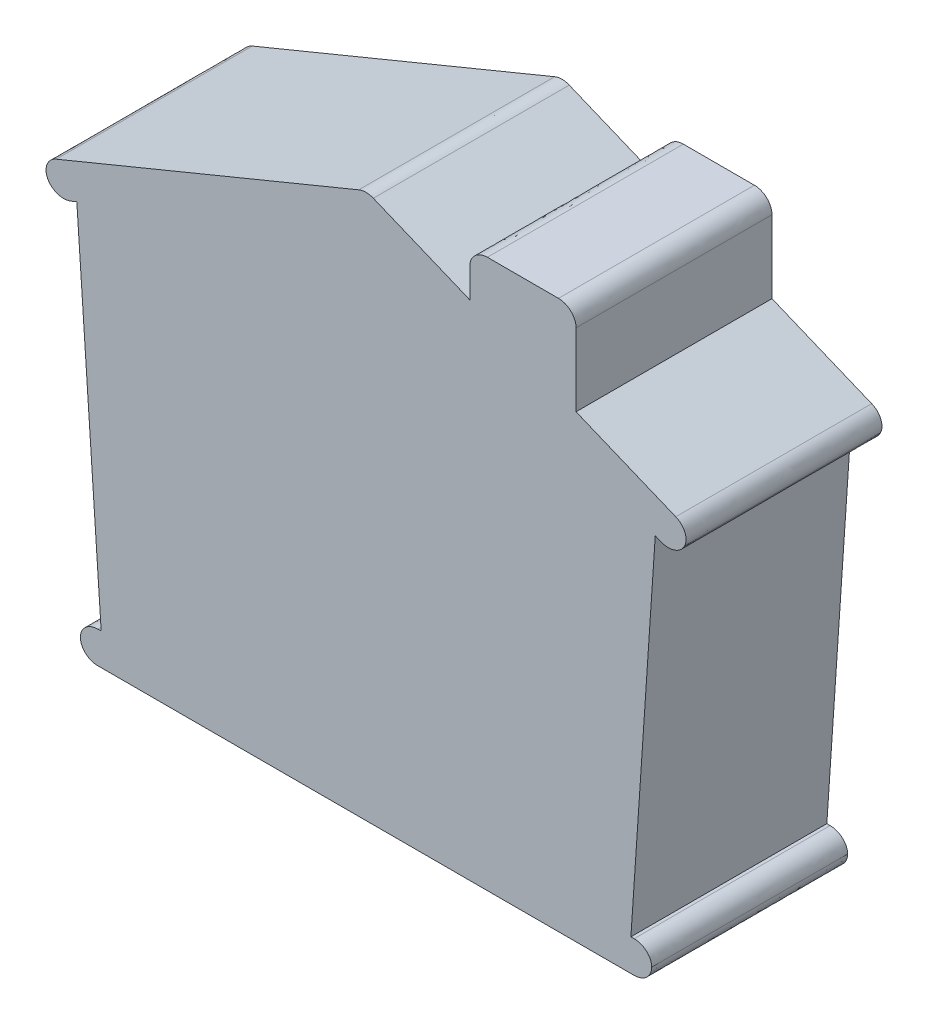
ISO-10303-21;
HEADER;
FILE_DESCRIPTION(('STEP AP214'),'2;1');
FILE_NAME('part.step','',(''),(''),'','','');
FILE_SCHEMA(('AUTOMOTIVE_DESIGN { 1 0 10303 214 1 1 1 1 }'));
ENDSEC;
DATA;
#1=APPLICATION_CONTEXT('core data for automotive mechanical design processes');
#2=APPLICATION_PROTOCOL_DEFINITION('international standard','automotive_design',2000,#1);
#3=PRODUCT_CONTEXT('',#1,'mechanical');
#4=PRODUCT('Part','Part','',(#3));
#5=PRODUCT_RELATED_PRODUCT_CATEGORY('part','',(#4));
#6=PRODUCT_DEFINITION_FORMATION('','',#4);
#7=PRODUCT_DEFINITION_CONTEXT('part definition',#1,'design');
#8=PRODUCT_DEFINITION('design','',#6,#7);
#9=PRODUCT_DEFINITION_SHAPE('','',#8);
#10=(LENGTH_UNIT() NAMED_UNIT(*) SI_UNIT(.MILLI.,.METRE.));
#11=(NAMED_UNIT(*) PLANE_ANGLE_UNIT() SI_UNIT($,.RADIAN.));
#12=(NAMED_UNIT(*) SI_UNIT($,.STERADIAN.) SOLID_ANGLE_UNIT());
#13=UNCERTAINTY_MEASURE_WITH_UNIT(LENGTH_MEASURE(1.E-05),#10,'distance_accuracy_value','');
#14=(GEOMETRIC_REPRESENTATION_CONTEXT(3) GLOBAL_UNCERTAINTY_ASSIGNED_CONTEXT((#13)) GLOBAL_UNIT_ASSIGNED_CONTEXT((#10,
#11,#12)) REPRESENTATION_CONTEXT('',''));
#15=CARTESIAN_POINT('',(0.,0.,0.));
#16=DIRECTION('',(0.,0.,1.));
#17=DIRECTION('',(1.,0.,0.));
#18=AXIS2_PLACEMENT_3D('',#15,#16,#17);
#19=CARTESIAN_POINT('',(54.7063993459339,-117.828000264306,25.));
#20=CARTESIAN_POINT('',(55.7428993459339,-133.106000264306,25.));
#21=CARTESIAN_POINT('',(56.7792993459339,-148.415600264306,25.));
#22=CARTESIAN_POINT('',(57.8153993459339,-163.702200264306,25.));
#23=B_SPLINE_CURVE_WITH_KNOTS('',3,(#19,#20,#21,#22),.UNSPECIFIED.,.F.,.F.,(4,4),(0.,
0.0344827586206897),.UNSPECIFIED.);
#24=DIRECTION('',(0.,0.,-1.));
#25=VECTOR('',#24,1.);
#26=SURFACE_OF_LINEAR_EXTRUSION('',#23,#25);
#27=CARTESIAN_POINT('',(54.7063993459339,-117.828000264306,0.));
#28=CARTESIAN_POINT('',(55.7428993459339,-133.106000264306,0.));
#29=CARTESIAN_POINT('',(56.7792993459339,-148.415600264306,0.));
#30=CARTESIAN_POINT('',(57.8153993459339,-163.702200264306,0.));
#31=B_SPLINE_CURVE_WITH_KNOTS('',3,(#27,#28,#29,#30),.UNSPECIFIED.,.F.,.F.,(4,4),(0.,
0.0344827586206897),.UNSPECIFIED.);
#32=CARTESIAN_POINT('',(54.7063993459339,-117.828000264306,0.));
#33=VERTEX_POINT('',#32);
#34=CARTESIAN_POINT('',(57.8153993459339,-163.702200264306,0.));
#35=VERTEX_POINT('',#34);
#36=EDGE_CURVE('E422',#33,#35,#31,.T.);
#37=ORIENTED_EDGE('',*,*,#36,.T.);
#38=DIRECTION('',(0.,0.,-1.));
#39=VECTOR('',#38,1.);
#40=CARTESIAN_POINT('',(57.8153993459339,-163.702200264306,25.));
#41=LINE('',#40,#39);
#42=CARTESIAN_POINT('',(57.8153993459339,-163.702200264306,25.));
#43=VERTEX_POINT('',#42);
#44=EDGE_CURVE('E11',#43,#35,#41,.T.);
#45=ORIENTED_EDGE('',*,*,#44,.F.);
#46=CARTESIAN_POINT('',(54.7063993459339,-117.828000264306,25.));
#47=VERTEX_POINT('',#46);
#48=EDGE_CURVE('E563',#47,#43,#23,.T.);
#49=ORIENTED_EDGE('',*,*,#48,.F.);
#50=DIRECTION('',(0.,0.,-1.));
#51=VECTOR('',#50,1.);
#52=CARTESIAN_POINT('',(54.7063993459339,-117.828000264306,25.));
#53=LINE('',#52,#51);
#54=EDGE_CURVE('E236',#47,#33,#53,.T.);
#55=ORIENTED_EDGE('',*,*,#54,.T.);
#56=EDGE_LOOP('',(#37,#45,#49,#55));
#57=FACE_BOUND('',#56,.T.);
#58=ADVANCED_FACE('F35',(#57),#26,.F.);
#59=CARTESIAN_POINT('',(57.4029907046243,-163.702200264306,25.));
#60=DIRECTION('',(0.,-1.,0.));
#61=DIRECTION('',(0.,0.,-1.));
#62=AXIS2_PLACEMENT_3D('',#59,#60,#61);
#63=PLANE('',#62);
#64=DIRECTION('',(-1.,0.,0.));
#65=VECTOR('',#64,1.);
#66=CARTESIAN_POINT('',(57.4029907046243,-163.702200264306,0.));
#67=LINE('',#66,#65);
#68=CARTESIAN_POINT('',(57.4029907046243,-163.702200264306,0.));
#69=VERTEX_POINT('',#68);
#70=EDGE_CURVE('E416',#35,#69,#67,.T.);
#71=ORIENTED_EDGE('',*,*,#70,.T.);
#72=DIRECTION('',(0.,0.,-1.));
#73=VECTOR('',#72,1.);
#74=CARTESIAN_POINT('',(57.4029907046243,-163.702200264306,25.));
#75=LINE('',#74,#73);
#76=CARTESIAN_POINT('',(57.4029907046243,-163.702200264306,25.));
#77=VERTEX_POINT('',#76);
#78=EDGE_CURVE('E44',#77,#69,#75,.T.);
#79=ORIENTED_EDGE('',*,*,#78,.F.);
#80=DIRECTION('',(-1.,0.,0.));
#81=VECTOR('',#80,1.);
#82=CARTESIAN_POINT('',(57.4029907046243,-163.702200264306,25.));
#83=LINE('',#82,#81);
#84=EDGE_CURVE('E149',#43,#77,#83,.T.);
#85=ORIENTED_EDGE('',*,*,#84,.F.);
#86=ORIENTED_EDGE('',*,*,#44,.T.);
#87=EDGE_LOOP('',(#71,#79,#85,#86));
#88=FACE_BOUND('',#87,.T.);
#89=ADVANCED_FACE('F600',(#88),#63,.F.);
#90=CARTESIAN_POINT('',(57.4029907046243,-163.702200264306,25.));
#91=CARTESIAN_POINT('',(56.167595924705,-163.702200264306,25.));
#92=CARTESIAN_POINT('',(55.1600004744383,-164.613096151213,25.));
#93=CARTESIAN_POINT('',(55.1600001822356,-165.729891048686,25.));
#94=B_SPLINE_CURVE_WITH_KNOTS('',3,(#90,#91,#92,#93),.UNSPECIFIED.,.F.,.F.,(4,4),
(0.896551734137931,0.931034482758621),.UNSPECIFIED.);
#95=DIRECTION('',(0.,0.,-1.));
#96=VECTOR('',#95,1.);
#97=SURFACE_OF_LINEAR_EXTRUSION('',#94,#96);
#98=CARTESIAN_POINT('',(57.4029907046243,-163.702200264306,0.));
#99=CARTESIAN_POINT('',(56.167595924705,-163.702200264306,0.));
#100=CARTESIAN_POINT('',(55.1600004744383,-164.613096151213,0.));
#101=CARTESIAN_POINT('',(55.1600001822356,-165.729891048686,0.));
#102=B_SPLINE_CURVE_WITH_KNOTS('',3,(#98,#99,#100,#101),.UNSPECIFIED.,.F.,.F.,(4,4),
(0.896551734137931,0.931034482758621),.UNSPECIFIED.);
#103=CARTESIAN_POINT('',(55.1600001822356,-165.729891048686,0.));
#104=VERTEX_POINT('',#103);
#105=EDGE_CURVE('E410',#69,#104,#102,.T.);
#106=ORIENTED_EDGE('',*,*,#105,.T.);
#107=DIRECTION('',(0.,0.,-1.));
#108=VECTOR('',#107,1.);
#109=CARTESIAN_POINT('',(55.1600001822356,-165.729891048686,25.));
#110=LINE('',#109,#108);
#111=CARTESIAN_POINT('',(55.1600001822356,-165.729891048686,25.));
#112=VERTEX_POINT('',#111);
#113=EDGE_CURVE('E402',#112,#104,#110,.T.);
#114=ORIENTED_EDGE('',*,*,#113,.F.);
#115=EDGE_CURVE('E411',#77,#112,#94,.T.);
#116=ORIENTED_EDGE('',*,*,#115,.F.);
#117=ORIENTED_EDGE('',*,*,#78,.T.);
#118=EDGE_LOOP('',(#106,#114,#116,#117));
#119=FACE_BOUND('',#118,.T.);
#120=ADVANCED_FACE('F408',(#119),#97,.F.);
#121=CARTESIAN_POINT('',(55.1600001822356,-165.729891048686,25.));
#122=CARTESIAN_POINT('',(55.1600001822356,-166.846791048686,25.));
#123=CARTESIAN_POINT('',(56.1675998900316,-167.757690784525,25.));
#124=CARTESIAN_POINT('',(57.4029994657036,-167.757691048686,25.));
#125=B_SPLINE_CURVE_WITH_KNOTS('',3,(#121,#122,#123,#124),.UNSPECIFIED.,.F.,.F.,(4,4),
(0.827586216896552,0.862068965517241),.UNSPECIFIED.);
#126=DIRECTION('',(0.,0.,-1.));
#127=VECTOR('',#126,1.);
#128=SURFACE_OF_LINEAR_EXTRUSION('',#125,#127);
#129=CARTESIAN_POINT('',(55.1600001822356,-165.729891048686,0.));
#130=CARTESIAN_POINT('',(55.1600001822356,-166.846791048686,0.));
#131=CARTESIAN_POINT('',(56.1675998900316,-167.757690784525,0.));
#132=CARTESIAN_POINT('',(57.4029994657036,-167.757691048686,0.));
#133=B_SPLINE_CURVE_WITH_KNOTS('',3,(#129,#130,#131,#132),.UNSPECIFIED.,.F.,.F.,(4,4),
(0.827586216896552,0.862068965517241),.UNSPECIFIED.);
#134=CARTESIAN_POINT('',(57.4029994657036,-167.757691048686,0.));
#135=VERTEX_POINT('',#134);
#136=EDGE_CURVE('E418',#104,#135,#133,.T.);
#137=ORIENTED_EDGE('',*,*,#136,.T.);
#138=DIRECTION('',(0.,0.,-1.));
#139=VECTOR('',#138,1.);
#140=CARTESIAN_POINT('',(57.4029994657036,-167.757691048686,25.));
#141=LINE('',#140,#139);
#142=CARTESIAN_POINT('',(57.4029994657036,-167.757691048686,25.));
#143=VERTEX_POINT('',#142);
#144=EDGE_CURVE('E399',#143,#135,#141,.T.);
#145=ORIENTED_EDGE('',*,*,#144,.F.);
#146=EDGE_CURVE('E588',#112,#143,#125,.T.);
#147=ORIENTED_EDGE('',*,*,#146,.F.);
#148=ORIENTED_EDGE('',*,*,#113,.T.);
#149=EDGE_LOOP('',(#137,#145,#147,#148));
#150=FACE_BOUND('',#149,.T.);
#151=ADVANCED_FACE('F599',(#150),#128,.F.);
#152=CARTESIAN_POINT('',(57.4029994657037,-167.757691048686,25.));
#153=DIRECTION('',(0.,1.,0.));
#154=DIRECTION('',(0.,0.,1.));
#155=AXIS2_PLACEMENT_3D('',#152,#153,#154);
#156=PLANE('',#155);
#157=CARTESIAN_POINT('',(57.4029994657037,-167.757691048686,0.));
#158=CARTESIAN_POINT('',(125.814679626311,-167.757691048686,0.));
#159=CARTESIAN_POINT('',(125.814699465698,-167.757691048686,0.));
#160=B_SPLINE_CURVE_WITH_KNOTS('',2,(#157,#158,#159),.UNSPECIFIED.,.F.,.F.,(3,3),
(0.793103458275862,0.827586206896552),.UNSPECIFIED.);
#161=CARTESIAN_POINT('',(125.814699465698,-167.757691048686,0.));
#162=VERTEX_POINT('',#161);
#163=EDGE_CURVE('E420',#135,#162,#160,.T.);
#164=ORIENTED_EDGE('',*,*,#163,.T.);
#165=DIRECTION('',(0.,0.,-1.));
#166=VECTOR('',#165,1.);
#167=CARTESIAN_POINT('',(125.814699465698,-167.757691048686,25.));
#168=LINE('',#167,#166);
#169=CARTESIAN_POINT('',(125.814699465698,-167.757691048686,25.));
#170=VERTEX_POINT('',#169);
#171=EDGE_CURVE('E396',#170,#162,#168,.T.);
#172=ORIENTED_EDGE('',*,*,#171,.F.);
#173=CARTESIAN_POINT('',(57.4029994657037,-167.757691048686,25.));
#174=CARTESIAN_POINT('',(125.814679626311,-167.757691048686,25.));
#175=CARTESIAN_POINT('',(125.814699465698,-167.757691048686,25.));
#176=B_SPLINE_CURVE_WITH_KNOTS('',2,(#173,#174,#175),.UNSPECIFIED.,.F.,.F.,(3,3),
(0.793103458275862,0.827586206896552),.UNSPECIFIED.);
#177=EDGE_CURVE('E904',#143,#170,#176,.T.);
#178=ORIENTED_EDGE('',*,*,#177,.F.);
#179=ORIENTED_EDGE('',*,*,#144,.T.);
#180=EDGE_LOOP('',(#164,#172,#178,#179));
#181=FACE_BOUND('',#180,.T.);
#182=ADVANCED_FACE('F627',(#181),#156,.F.);
#183=CARTESIAN_POINT('',(125.814699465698,-167.757691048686,25.));
#184=CARTESIAN_POINT('',(127.050099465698,-167.757691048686,25.));
#185=CARTESIAN_POINT('',(128.057699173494,-166.846791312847,25.));
#186=CARTESIAN_POINT('',(128.057699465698,-165.729891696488,25.));
#187=B_SPLINE_CURVE_WITH_KNOTS('',3,(#183,#184,#185,#186),.UNSPECIFIED.,.F.,.F.,(4,4),
(0.758620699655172,0.793103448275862),.UNSPECIFIED.);
#188=DIRECTION('',(0.,0.,-1.));
#189=VECTOR('',#188,1.);
#190=SURFACE_OF_LINEAR_EXTRUSION('',#187,#189);
#191=CARTESIAN_POINT('',(125.814699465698,-167.757691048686,0.));
#192=CARTESIAN_POINT('',(127.050099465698,-167.757691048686,0.));
#193=CARTESIAN_POINT('',(128.057699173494,-166.846791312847,0.));
#194=CARTESIAN_POINT('',(128.057699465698,-165.729891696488,0.));
#195=B_SPLINE_CURVE_WITH_KNOTS('',3,(#191,#192,#193,#194),.UNSPECIFIED.,.F.,.F.,(4,4),
(0.758620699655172,0.793103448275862),.UNSPECIFIED.);
#196=CARTESIAN_POINT('',(128.057699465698,-165.729891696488,0.));
#197=VERTEX_POINT('',#196);
#198=EDGE_CURVE('E438',#162,#197,#195,.T.);
#199=ORIENTED_EDGE('',*,*,#198,.T.);
#200=DIRECTION('',(0.,0.,-1.));
#201=VECTOR('',#200,1.);
#202=CARTESIAN_POINT('',(128.057699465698,-165.729891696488,25.));
#203=LINE('',#202,#201);
#204=CARTESIAN_POINT('',(128.057699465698,-165.729891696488,25.));
#205=VERTEX_POINT('',#204);
#206=EDGE_CURVE('E393',#205,#197,#203,.T.);
#207=ORIENTED_EDGE('',*,*,#206,.F.);
#208=EDGE_CURVE('E901',#170,#205,#187,.T.);
#209=ORIENTED_EDGE('',*,*,#208,.F.);
#210=ORIENTED_EDGE('',*,*,#171,.T.);
#211=EDGE_LOOP('',(#199,#207,#209,#210));
#212=FACE_BOUND('',#211,.T.);
#213=ADVANCED_FACE('F636',(#212),#190,.F.);
#214=CARTESIAN_POINT('',(128.057699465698,-165.729891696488,25.));
#215=CARTESIAN_POINT('',(128.057699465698,-164.613091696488,25.));
#216=CARTESIAN_POINT('',(127.050099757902,-163.702191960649,25.));
#217=CARTESIAN_POINT('',(125.81470018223,-163.702191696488,25.));
#218=B_SPLINE_CURVE_WITH_KNOTS('',3,(#214,#215,#216,#217),.UNSPECIFIED.,.F.,.F.,(4,4),
(0.689655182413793,0.724137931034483),.UNSPECIFIED.);
#219=DIRECTION('',(0.,0.,-1.));
#220=VECTOR('',#219,1.);
#221=SURFACE_OF_LINEAR_EXTRUSION('',#218,#220);
#222=CARTESIAN_POINT('',(128.057699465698,-165.729891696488,0.));
#223=CARTESIAN_POINT('',(128.057699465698,-164.613091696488,0.));
#224=CARTESIAN_POINT('',(127.050099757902,-163.702191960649,0.));
#225=CARTESIAN_POINT('',(125.81470018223,-163.702191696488,0.));
#226=B_SPLINE_CURVE_WITH_KNOTS('',3,(#222,#223,#224,#225),.UNSPECIFIED.,.F.,.F.,(4,4),
(0.689655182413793,0.724137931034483),.UNSPECIFIED.);
#227=CARTESIAN_POINT('',(125.81470018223,-163.702191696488,0.));
#228=VERTEX_POINT('',#227);
#229=EDGE_CURVE('E445',#197,#228,#226,.T.);
#230=ORIENTED_EDGE('',*,*,#229,.T.);
#231=DIRECTION('',(0.,0.,-1.));
#232=VECTOR('',#231,1.);
#233=CARTESIAN_POINT('',(125.81470018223,-163.702191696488,25.));
#234=LINE('',#233,#232);
#235=CARTESIAN_POINT('',(125.81470018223,-163.702191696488,25.));
#236=VERTEX_POINT('',#235);
#237=EDGE_CURVE('E390',#236,#228,#234,.T.);
#238=ORIENTED_EDGE('',*,*,#237,.F.);
#239=EDGE_CURVE('E899',#205,#236,#218,.T.);
#240=ORIENTED_EDGE('',*,*,#239,.F.);
#241=ORIENTED_EDGE('',*,*,#206,.T.);
#242=EDGE_LOOP('',(#230,#238,#240,#241));
#243=FACE_BOUND('',#242,.T.);
#244=ADVANCED_FACE('F645',(#243),#221,.F.);
#245=CARTESIAN_POINT('',(125.81470018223,-163.702191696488,25.));
#246=DIRECTION('',(0.,-1.,0.));
#247=DIRECTION('',(0.,0.,-1.));
#248=AXIS2_PLACEMENT_3D('',#245,#246,#247);
#249=PLANE('',#248);
#250=DIRECTION('',(-1.,0.,0.));
#251=VECTOR('',#250,1.);
#252=CARTESIAN_POINT('',(125.81470018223,-163.702191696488,0.));
#253=LINE('',#252,#251);
#254=CARTESIAN_POINT('',(125.402299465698,-163.702191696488,0.));
#255=VERTEX_POINT('',#254);
#256=EDGE_CURVE('E452',#228,#255,#253,.T.);
#257=ORIENTED_EDGE('',*,*,#256,.T.);
#258=DIRECTION('',(0.,0.,-1.));
#259=VECTOR('',#258,1.);
#260=CARTESIAN_POINT('',(125.402299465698,-163.702191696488,25.));
#261=LINE('',#260,#259);
#262=CARTESIAN_POINT('',(125.402299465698,-163.702191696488,25.));
#263=VERTEX_POINT('',#262);
#264=EDGE_CURVE('E387',#263,#255,#261,.T.);
#265=ORIENTED_EDGE('',*,*,#264,.F.);
#266=DIRECTION('',(-1.,0.,0.));
#267=VECTOR('',#266,1.);
#268=CARTESIAN_POINT('',(125.81470018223,-163.702191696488,25.));
#269=LINE('',#268,#267);
#270=EDGE_CURVE('E893',#236,#263,#269,.T.);
#271=ORIENTED_EDGE('',*,*,#270,.F.);
#272=ORIENTED_EDGE('',*,*,#237,.T.);
#273=EDGE_LOOP('',(#257,#265,#271,#272));
#274=FACE_BOUND('',#273,.T.);
#275=ADVANCED_FACE('F655',(#274),#249,.F.);
#276=CARTESIAN_POINT('',(125.402299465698,-163.702191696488,25.));
#277=CARTESIAN_POINT('',(126.438299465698,-148.415591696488,25.));
#278=CARTESIAN_POINT('',(127.474799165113,-133.105996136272,25.));
#279=CARTESIAN_POINT('',(128.511298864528,-117.828000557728,25.));
#280=B_SPLINE_CURVE_WITH_KNOTS('',3,(#276,#277,#278,#279),.UNSPECIFIED.,.F.,.F.,(4,4),
(0.620689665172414,0.655172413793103),.UNSPECIFIED.);
#281=DIRECTION('',(0.,0.,-1.));
#282=VECTOR('',#281,1.);
#283=SURFACE_OF_LINEAR_EXTRUSION('',#280,#282);
#284=CARTESIAN_POINT('',(125.402299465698,-163.702191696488,0.));
#285=CARTESIAN_POINT('',(126.438299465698,-148.415591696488,0.));
#286=CARTESIAN_POINT('',(127.474799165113,-133.105996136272,0.));
#287=CARTESIAN_POINT('',(128.511298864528,-117.828000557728,0.));
#288=B_SPLINE_CURVE_WITH_KNOTS('',3,(#284,#285,#286,#287),.UNSPECIFIED.,.F.,.F.,(4,4),
(0.620689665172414,0.655172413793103),.UNSPECIFIED.);
#289=CARTESIAN_POINT('',(128.511298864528,-117.828000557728,0.));
#290=VERTEX_POINT('',#289);
#291=EDGE_CURVE('E457',#255,#290,#288,.T.);
#292=ORIENTED_EDGE('',*,*,#291,.T.);
#293=DIRECTION('',(0.,0.,-1.));
#294=VECTOR('',#293,1.);
#295=CARTESIAN_POINT('',(128.511298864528,-117.828000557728,25.));
#296=LINE('',#295,#294);
#297=CARTESIAN_POINT('',(128.511298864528,-117.828000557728,25.));
#298=VERTEX_POINT('',#297);
#299=EDGE_CURVE('E384',#298,#290,#296,.T.);
#300=ORIENTED_EDGE('',*,*,#299,.F.);
#301=EDGE_CURVE('E890',#263,#298,#280,.T.);
#302=ORIENTED_EDGE('',*,*,#301,.F.);
#303=ORIENTED_EDGE('',*,*,#264,.T.);
#304=EDGE_LOOP('',(#292,#300,#302,#303));
#305=FACE_BOUND('',#304,.T.);
#306=ADVANCED_FACE('F665',(#305),#283,.F.);
#307=CARTESIAN_POINT('',(128.511298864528,-117.828000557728,25.));
#308=DIRECTION('',(0.374809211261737,0.927101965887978,0.));
#309=DIRECTION('',(-0.927101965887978,0.374809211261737,0.));
#310=AXIS2_PLACEMENT_3D('',#307,#308,#309);
#311=PLANE('',#310);
#312=CARTESIAN_POINT('',(128.511298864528,-117.828000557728,0.));
#313=CARTESIAN_POINT('',(129.272898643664,-118.135900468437,0.));
#314=CARTESIAN_POINT('',(129.272898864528,-118.135900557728,0.));
#315=B_SPLINE_CURVE_WITH_KNOTS('',2,(#312,#313,#314),.UNSPECIFIED.,.F.,.F.,(3,3),
(0.586206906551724,0.620689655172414),.UNSPECIFIED.);
#316=CARTESIAN_POINT('',(129.272898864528,-118.135900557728,0.));
#317=VERTEX_POINT('',#316);
#318=EDGE_CURVE('E461',#290,#317,#315,.T.);
#319=ORIENTED_EDGE('',*,*,#318,.T.);
#320=DIRECTION('',(0.,0.,-1.));
#321=VECTOR('',#320,1.);
#322=CARTESIAN_POINT('',(129.272898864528,-118.135900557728,25.));
#323=LINE('',#322,#321);
#324=CARTESIAN_POINT('',(129.272898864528,-118.135900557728,25.));
#325=VERTEX_POINT('',#324);
#326=EDGE_CURVE('E381',#325,#317,#323,.T.);
#327=ORIENTED_EDGE('',*,*,#326,.F.);
#328=CARTESIAN_POINT('',(128.511298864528,-117.828000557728,25.));
#329=CARTESIAN_POINT('',(129.272898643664,-118.135900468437,25.));
#330=CARTESIAN_POINT('',(129.272898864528,-118.135900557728,25.));
#331=B_SPLINE_CURVE_WITH_KNOTS('',2,(#328,#329,#330),.UNSPECIFIED.,.F.,.F.,(3,3),
(0.586206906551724,0.620689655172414),.UNSPECIFIED.);
#332=EDGE_CURVE('E888',#298,#325,#331,.T.);
#333=ORIENTED_EDGE('',*,*,#332,.F.);
#334=ORIENTED_EDGE('',*,*,#299,.T.);
#335=EDGE_LOOP('',(#319,#327,#333,#334));
#336=FACE_BOUND('',#335,.T.);
#337=ADVANCED_FACE('F675',(#336),#311,.F.);
#338=CARTESIAN_POINT('',(129.272898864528,-118.135900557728,25.));
#339=CARTESIAN_POINT('',(130.400598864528,-118.591700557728,25.));
#340=CARTESIAN_POINT('',(131.731898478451,-118.131700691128,25.));
#341=CARTESIAN_POINT('',(132.235898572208,-117.11230114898,25.));
#342=B_SPLINE_CURVE_WITH_KNOTS('',3,(#338,#339,#340,#341),.UNSPECIFIED.,.F.,.F.,(4,4),
(0.551724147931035,0.586206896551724),.UNSPECIFIED.);
#343=DIRECTION('',(0.,0.,-1.));
#344=VECTOR('',#343,1.);
#345=SURFACE_OF_LINEAR_EXTRUSION('',#342,#344);
#346=CARTESIAN_POINT('',(129.272898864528,-118.135900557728,0.));
#347=CARTESIAN_POINT('',(130.400598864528,-118.591700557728,0.));
#348=CARTESIAN_POINT('',(131.731898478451,-118.131700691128,0.));
#349=CARTESIAN_POINT('',(132.235898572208,-117.11230114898,0.));
#350=B_SPLINE_CURVE_WITH_KNOTS('',3,(#346,#347,#348,#349),.UNSPECIFIED.,.F.,.F.,(4,4),
(0.551724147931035,0.586206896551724),.UNSPECIFIED.);
#351=CARTESIAN_POINT('',(132.235898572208,-117.11230114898,0.));
#352=VERTEX_POINT('',#351);
#353=EDGE_CURVE('E468',#317,#352,#350,.T.);
#354=ORIENTED_EDGE('',*,*,#353,.T.);
#355=DIRECTION('',(0.,0.,-1.));
#356=VECTOR('',#355,1.);
#357=CARTESIAN_POINT('',(132.235898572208,-117.11230114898,25.));
#358=LINE('',#357,#356);
#359=CARTESIAN_POINT('',(132.235898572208,-117.11230114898,25.));
#360=VERTEX_POINT('',#359);
#361=EDGE_CURVE('E378',#360,#352,#358,.T.);
#362=ORIENTED_EDGE('',*,*,#361,.F.);
#363=EDGE_CURVE('E881',#325,#360,#342,.T.);
#364=ORIENTED_EDGE('',*,*,#363,.F.);
#365=ORIENTED_EDGE('',*,*,#326,.T.);
#366=EDGE_LOOP('',(#354,#362,#364,#365));
#367=FACE_BOUND('',#366,.T.);
#368=ADVANCED_FACE('F685',(#367),#345,.F.);
#369=CARTESIAN_POINT('',(132.242598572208,-117.09890114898,25.));
#370=DIRECTION('',(-0.894427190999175,0.44721359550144,0.));
#371=DIRECTION('',(-0.44721359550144,-0.894427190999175,0.));
#372=AXIS2_PLACEMENT_3D('',#369,#370,#371);
#373=PLANE('',#372);
#374=DIRECTION('',(0.44721359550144,0.894427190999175,0.));
#375=VECTOR('',#374,1.);
#376=CARTESIAN_POINT('',(132.242598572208,-117.09890114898,0.));
#377=LINE('',#376,#375);
#378=CARTESIAN_POINT('',(132.242598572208,-117.09890114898,0.));
#379=VERTEX_POINT('',#378);
#380=EDGE_CURVE('E475',#352,#379,#377,.T.);
#381=ORIENTED_EDGE('',*,*,#380,.T.);
#382=DIRECTION('',(0.,0.,-1.));
#383=VECTOR('',#382,1.);
#384=CARTESIAN_POINT('',(132.242598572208,-117.09890114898,25.));
#385=LINE('',#384,#383);
#386=CARTESIAN_POINT('',(132.242598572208,-117.09890114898,25.));
#387=VERTEX_POINT('',#386);
#388=EDGE_CURVE('E375',#387,#379,#385,.T.);
#389=ORIENTED_EDGE('',*,*,#388,.F.);
#390=DIRECTION('',(0.44721359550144,0.894427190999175,0.));
#391=VECTOR('',#390,1.);
#392=CARTESIAN_POINT('',(132.242598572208,-117.09890114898,25.));
#393=LINE('',#392,#391);
#394=EDGE_CURVE('E856',#360,#387,#393,.T.);
#395=ORIENTED_EDGE('',*,*,#394,.F.);
#396=ORIENTED_EDGE('',*,*,#361,.T.);
#397=EDGE_LOOP('',(#381,#389,#395,#396));
#398=FACE_BOUND('',#397,.T.);
#399=ADVANCED_FACE('F695',(#398),#373,.F.);
#400=CARTESIAN_POINT('',(132.242598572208,-117.09890114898,25.));
#401=CARTESIAN_POINT('',(132.741898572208,-116.08340114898,25.));
#402=CARTESIAN_POINT('',(132.243998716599,-114.887201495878,25.));
#403=CARTESIAN_POINT('',(131.12509922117,-114.426101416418,25.));
#404=B_SPLINE_CURVE_WITH_KNOTS('',3,(#400,#401,#402,#403),.UNSPECIFIED.,.F.,.F.,(4,4),
(0.482758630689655,0.517241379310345),.UNSPECIFIED.);
#405=DIRECTION('',(0.,0.,-1.));
#406=VECTOR('',#405,1.);
#407=SURFACE_OF_LINEAR_EXTRUSION('',#404,#406);
#408=CARTESIAN_POINT('',(132.242598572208,-117.09890114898,0.));
#409=CARTESIAN_POINT('',(132.741898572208,-116.08340114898,0.));
#410=CARTESIAN_POINT('',(132.243998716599,-114.887201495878,0.));
#411=CARTESIAN_POINT('',(131.12509922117,-114.426101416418,0.));
#412=B_SPLINE_CURVE_WITH_KNOTS('',3,(#408,#409,#410,#411),.UNSPECIFIED.,.F.,.F.,(4,4),
(0.482758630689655,0.517241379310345),.UNSPECIFIED.);
#413=CARTESIAN_POINT('',(131.12509922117,-114.426101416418,0.));
#414=VERTEX_POINT('',#413);
#415=EDGE_CURVE('E480',#379,#414,#412,.T.);
#416=ORIENTED_EDGE('',*,*,#415,.T.);
#417=DIRECTION('',(0.,0.,-1.));
#418=VECTOR('',#417,1.);
#419=CARTESIAN_POINT('',(131.12509922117,-114.426101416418,25.));
#420=LINE('',#419,#418);
#421=CARTESIAN_POINT('',(131.12509922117,-114.426101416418,25.));
#422=VERTEX_POINT('',#421);
#423=EDGE_CURVE('E372',#422,#414,#420,.T.);
#424=ORIENTED_EDGE('',*,*,#423,.F.);
#425=EDGE_CURVE('E851',#387,#422,#404,.T.);
#426=ORIENTED_EDGE('',*,*,#425,.F.);
#427=ORIENTED_EDGE('',*,*,#388,.T.);
#428=EDGE_LOOP('',(#416,#424,#426,#427));
#429=FACE_BOUND('',#428,.T.);
#430=ADVANCED_FACE('F705',(#429),#407,.F.);
#431=CARTESIAN_POINT('',(131.12509922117,-114.426101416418,25.));
#432=DIRECTION('',(-0.381048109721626,-0.924555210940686,0.));
#433=DIRECTION('',(0.924555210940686,-0.381048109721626,0.));
#434=AXIS2_PLACEMENT_3D('',#431,#432,#433);
#435=PLANE('',#434);
#436=CARTESIAN_POINT('',(131.12509922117,-114.426101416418,0.));
#437=CARTESIAN_POINT('',(118.405702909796,-109.183902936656,0.));
#438=CARTESIAN_POINT('',(118.405699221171,-109.183901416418,0.));
#439=B_SPLINE_CURVE_WITH_KNOTS('',2,(#436,#437,#438),.UNSPECIFIED.,.F.,.F.,(3,3),
(0.448275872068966,0.482758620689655),.UNSPECIFIED.);
#440=CARTESIAN_POINT('',(118.405699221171,-109.183901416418,0.));
#441=VERTEX_POINT('',#440);
#442=EDGE_CURVE('E484',#414,#441,#439,.T.);
#443=ORIENTED_EDGE('',*,*,#442,.T.);
#444=DIRECTION('',(0.,0.,-1.));
#445=VECTOR('',#444,1.);
#446=CARTESIAN_POINT('',(118.405699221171,-109.183901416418,25.));
#447=LINE('',#446,#445);
#448=CARTESIAN_POINT('',(118.405699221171,-109.183901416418,25.));
#449=VERTEX_POINT('',#448);
#450=EDGE_CURVE('E369',#449,#441,#447,.T.);
#451=ORIENTED_EDGE('',*,*,#450,.F.);
#452=CARTESIAN_POINT('',(131.12509922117,-114.426101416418,25.));
#453=CARTESIAN_POINT('',(118.405702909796,-109.183902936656,25.));
#454=CARTESIAN_POINT('',(118.405699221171,-109.183901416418,25.));
#455=B_SPLINE_CURVE_WITH_KNOTS('',2,(#452,#453,#454),.UNSPECIFIED.,.F.,.F.,(3,3),
(0.448275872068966,0.482758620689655),.UNSPECIFIED.);
#456=EDGE_CURVE('E839',#422,#449,#455,.T.);
#457=ORIENTED_EDGE('',*,*,#456,.F.);
#458=ORIENTED_EDGE('',*,*,#423,.T.);
#459=EDGE_LOOP('',(#443,#451,#457,#458));
#460=FACE_BOUND('',#459,.T.);
#461=ADVANCED_FACE('F715',(#460),#435,.F.);
#462=CARTESIAN_POINT('',(118.405699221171,-109.183901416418,25.));
#463=DIRECTION('',(-1.,0.,0.));
#464=DIRECTION('',(0.,-1.,0.));
#465=AXIS2_PLACEMENT_3D('',#462,#463,#464);
#466=PLANE('',#465);
#467=CARTESIAN_POINT('',(118.405699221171,-109.183901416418,0.));
#468=CARTESIAN_POINT('',(118.405699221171,-99.9065041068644,0.));
#469=CARTESIAN_POINT('',(118.405699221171,-99.9065014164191,0.));
#470=B_SPLINE_CURVE_WITH_KNOTS('',2,(#467,#468,#469),.UNSPECIFIED.,.F.,.F.,(3,3),
(0.413793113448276,0.448275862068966),.UNSPECIFIED.);
#471=CARTESIAN_POINT('',(118.405699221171,-99.9065014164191,0.));
#472=VERTEX_POINT('',#471);
#473=EDGE_CURVE('E491',#441,#472,#470,.T.);
#474=ORIENTED_EDGE('',*,*,#473,.T.);
#475=DIRECTION('',(0.,0.,-1.));
#476=VECTOR('',#475,1.);
#477=CARTESIAN_POINT('',(118.405699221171,-99.9065014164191,25.));
#478=LINE('',#477,#476);
#479=CARTESIAN_POINT('',(118.405699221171,-99.9065014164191,25.));
#480=VERTEX_POINT('',#479);
#481=EDGE_CURVE('E366',#480,#472,#478,.T.);
#482=ORIENTED_EDGE('',*,*,#481,.F.);
#483=CARTESIAN_POINT('',(118.405699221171,-109.183901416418,25.));
#484=CARTESIAN_POINT('',(118.405699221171,-99.9065041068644,25.));
#485=CARTESIAN_POINT('',(118.405699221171,-99.9065014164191,25.));
#486=B_SPLINE_CURVE_WITH_KNOTS('',2,(#483,#484,#485),.UNSPECIFIED.,.F.,.F.,(3,3),
(0.413793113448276,0.448275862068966),.UNSPECIFIED.);
#487=EDGE_CURVE('E838',#449,#480,#486,.T.);
#488=ORIENTED_EDGE('',*,*,#487,.F.);
#489=ORIENTED_EDGE('',*,*,#450,.T.);
#490=EDGE_LOOP('',(#474,#482,#488,#489));
#491=FACE_BOUND('',#490,.T.);
#492=ADVANCED_FACE('F725',(#491),#466,.F.);
#493=CARTESIAN_POINT('',(118.405699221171,-99.9065014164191,25.));
#494=CARTESIAN_POINT('',(118.405699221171,-98.7303014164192,25.));
#495=CARTESIAN_POINT('',(117.398099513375,-97.7709016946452,25.));
#496=CARTESIAN_POINT('',(116.162699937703,-97.7704014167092,25.));
#497=B_SPLINE_CURVE_WITH_KNOTS('',3,(#493,#494,#495,#496),.UNSPECIFIED.,.F.,.F.,(4,4),
(0.379310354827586,0.413793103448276),.UNSPECIFIED.);
#498=DIRECTION('',(0.,0.,-1.));
#499=VECTOR('',#498,1.);
#500=SURFACE_OF_LINEAR_EXTRUSION('',#497,#499);
#501=CARTESIAN_POINT('',(118.405699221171,-99.9065014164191,0.));
#502=CARTESIAN_POINT('',(118.405699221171,-98.7303014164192,0.));
#503=CARTESIAN_POINT('',(117.398099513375,-97.7709016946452,0.));
#504=CARTESIAN_POINT('',(116.162699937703,-97.7704014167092,0.));
#505=B_SPLINE_CURVE_WITH_KNOTS('',3,(#501,#502,#503,#504),.UNSPECIFIED.,.F.,.F.,(4,4),
(0.379310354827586,0.413793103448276),.UNSPECIFIED.);
#506=CARTESIAN_POINT('',(116.162699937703,-97.7704014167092,0.));
#507=VERTEX_POINT('',#506);
#508=EDGE_CURVE('E498',#472,#507,#505,.T.);
#509=ORIENTED_EDGE('',*,*,#508,.T.);
#510=DIRECTION('',(0.,0.,-1.));
#511=VECTOR('',#510,1.);
#512=CARTESIAN_POINT('',(116.162699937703,-97.7704014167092,25.));
#513=LINE('',#512,#511);
#514=CARTESIAN_POINT('',(116.162699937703,-97.7704014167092,25.));
#515=VERTEX_POINT('',#514);
#516=EDGE_CURVE('E363',#515,#507,#513,.T.);
#517=ORIENTED_EDGE('',*,*,#516,.F.);
#518=EDGE_CURVE('E837',#480,#515,#497,.T.);
#519=ORIENTED_EDGE('',*,*,#518,.F.);
#520=ORIENTED_EDGE('',*,*,#481,.T.);
#521=EDGE_LOOP('',(#509,#517,#519,#520));
#522=FACE_BOUND('',#521,.T.);
#523=ADVANCED_FACE('F735',(#522),#500,.F.);
#524=CARTESIAN_POINT('',(116.162699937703,-97.7704014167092,25.));
#525=DIRECTION('',(-0.000562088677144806,-0.999999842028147,0.));
#526=DIRECTION('',(0.999999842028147,-0.000562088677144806,0.));
#527=AXIS2_PLACEMENT_3D('',#524,#525,#526);
#528=PLANE('',#527);
#529=CARTESIAN_POINT('',(116.162699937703,-97.7704014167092,0.));
#530=CARTESIAN_POINT('',(107.08940256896,-97.7653014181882,0.));
#531=CARTESIAN_POINT('',(107.089399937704,-97.7653014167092,0.));
#532=B_SPLINE_CURVE_WITH_KNOTS('',2,(#529,#530,#531),.UNSPECIFIED.,.F.,.F.,(3,3),
(0.344827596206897,0.379310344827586),.UNSPECIFIED.);
#533=CARTESIAN_POINT('',(107.089399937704,-97.7653014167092,0.));
#534=VERTEX_POINT('',#533);
#535=EDGE_CURVE('E505',#507,#534,#532,.T.);
#536=ORIENTED_EDGE('',*,*,#535,.T.);
#537=DIRECTION('',(0.,0.,-1.));
#538=VECTOR('',#537,1.);
#539=CARTESIAN_POINT('',(107.089399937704,-97.7653014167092,25.));
#540=LINE('',#539,#538);
#541=CARTESIAN_POINT('',(107.089399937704,-97.7653014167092,25.));
#542=VERTEX_POINT('',#541);
#543=EDGE_CURVE('E360',#542,#534,#540,.T.);
#544=ORIENTED_EDGE('',*,*,#543,.F.);
#545=CARTESIAN_POINT('',(116.162699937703,-97.7704014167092,25.));
#546=CARTESIAN_POINT('',(107.08940256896,-97.7653014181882,25.));
#547=CARTESIAN_POINT('',(107.089399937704,-97.7653014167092,25.));
#548=B_SPLINE_CURVE_WITH_KNOTS('',2,(#545,#546,#547),.UNSPECIFIED.,.F.,.F.,(3,3),
(0.344827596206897,0.379310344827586),.UNSPECIFIED.);
#549=EDGE_CURVE('E313',#515,#542,#548,.T.);
#550=ORIENTED_EDGE('',*,*,#549,.F.);
#551=ORIENTED_EDGE('',*,*,#516,.T.);
#552=EDGE_LOOP('',(#536,#544,#550,#551));
#553=FACE_BOUND('',#552,.T.);
#554=ADVANCED_FACE('F304',(#553),#528,.F.);
#555=CARTESIAN_POINT('',(107.089399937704,-97.7653014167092,25.));
#556=CARTESIAN_POINT('',(105.853899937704,-97.7648014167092,25.));
#557=CARTESIAN_POINT('',(104.846400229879,-98.7249011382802,25.));
#558=CARTESIAN_POINT('',(104.846399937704,-99.9015007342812,25.));
#559=B_SPLINE_CURVE_WITH_KNOTS('',3,(#555,#556,#557,#558),.UNSPECIFIED.,.F.,.F.,(4,4),
(0.310344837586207,0.344827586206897),.UNSPECIFIED.);
#560=DIRECTION('',(0.,0.,-1.));
#561=VECTOR('',#560,1.);
#562=SURFACE_OF_LINEAR_EXTRUSION('',#559,#561);
#563=CARTESIAN_POINT('',(107.089399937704,-97.7653014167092,0.));
#564=CARTESIAN_POINT('',(105.853899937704,-97.7648014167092,0.));
#565=CARTESIAN_POINT('',(104.846400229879,-98.7249011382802,0.));
#566=CARTESIAN_POINT('',(104.846399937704,-99.9015007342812,0.));
#567=B_SPLINE_CURVE_WITH_KNOTS('',3,(#563,#564,#565,#566),.UNSPECIFIED.,.F.,.F.,(4,4),
(0.310344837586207,0.344827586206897),.UNSPECIFIED.);
#568=CARTESIAN_POINT('',(104.846399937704,-99.9015007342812,0.));
#569=VERTEX_POINT('',#568);
#570=EDGE_CURVE('E512',#534,#569,#567,.T.);
#571=ORIENTED_EDGE('',*,*,#570,.T.);
#572=DIRECTION('',(0.,0.,-1.));
#573=VECTOR('',#572,1.);
#574=CARTESIAN_POINT('',(104.846399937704,-99.9015007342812,25.));
#575=LINE('',#574,#573);
#576=CARTESIAN_POINT('',(104.846399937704,-99.9015007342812,25.));
#577=VERTEX_POINT('',#576);
#578=EDGE_CURVE('E357',#577,#569,#575,.T.);
#579=ORIENTED_EDGE('',*,*,#578,.F.);
#580=EDGE_CURVE('E307',#542,#577,#559,.T.);
#581=ORIENTED_EDGE('',*,*,#580,.F.);
#582=ORIENTED_EDGE('',*,*,#543,.T.);
#583=EDGE_LOOP('',(#571,#579,#581,#582));
#584=FACE_BOUND('',#583,.T.);
#585=ADVANCED_FACE('F299',(#584),#562,.F.);
#586=CARTESIAN_POINT('',(104.846399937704,-99.9015007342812,25.));
#587=DIRECTION('',(1.,0.,0.));
#588=DIRECTION('',(0.,1.,0.));
#589=AXIS2_PLACEMENT_3D('',#586,#587,#588);
#590=PLANE('',#589);
#591=CARTESIAN_POINT('',(104.846399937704,-99.9015007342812,0.));
#592=CARTESIAN_POINT('',(104.846399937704,-103.595199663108,0.));
#593=CARTESIAN_POINT('',(104.846399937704,-103.595200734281,0.));
#594=B_SPLINE_CURVE_WITH_KNOTS('',2,(#591,#592,#593),.UNSPECIFIED.,.F.,.F.,(3,3),
(0.275862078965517,0.310344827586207),.UNSPECIFIED.);
#595=CARTESIAN_POINT('',(104.846399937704,-103.595200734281,0.));
#596=VERTEX_POINT('',#595);
#597=EDGE_CURVE('E519',#569,#596,#594,.T.);
#598=ORIENTED_EDGE('',*,*,#597,.T.);
#599=DIRECTION('',(0.,0.,-1.));
#600=VECTOR('',#599,1.);
#601=CARTESIAN_POINT('',(104.846399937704,-103.595200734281,25.));
#602=LINE('',#601,#600);
#603=CARTESIAN_POINT('',(104.846399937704,-103.595200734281,25.));
#604=VERTEX_POINT('',#603);
#605=EDGE_CURVE('E337',#604,#596,#602,.T.);
#606=ORIENTED_EDGE('',*,*,#605,.F.);
#607=CARTESIAN_POINT('',(104.846399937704,-99.9015007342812,25.));
#608=CARTESIAN_POINT('',(104.846399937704,-103.595199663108,25.));
#609=CARTESIAN_POINT('',(104.846399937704,-103.595200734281,25.));
#610=B_SPLINE_CURVE_WITH_KNOTS('',2,(#607,#608,#609),.UNSPECIFIED.,.F.,.F.,(3,3),
(0.275862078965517,0.310344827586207),.UNSPECIFIED.);
#611=EDGE_CURVE('E312',#577,#604,#610,.T.);
#612=ORIENTED_EDGE('',*,*,#611,.F.);
#613=ORIENTED_EDGE('',*,*,#578,.T.);
#614=EDGE_LOOP('',(#598,#606,#612,#613));
#615=FACE_BOUND('',#614,.T.);
#616=ADVANCED_FACE('F295',(#615),#590,.F.);
#617=CARTESIAN_POINT('',(104.846399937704,-103.595200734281,25.));
#618=DIRECTION('',(-0.381071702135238,-0.924545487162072,0.));
#619=DIRECTION('',(0.924545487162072,-0.381071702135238,0.));
#620=AXIS2_PLACEMENT_3D('',#617,#618,#619);
#621=PLANE('',#620);
#622=CARTESIAN_POINT('',(104.846399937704,-103.595200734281,0.));
#623=CARTESIAN_POINT('',(92.5394035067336,-98.5226022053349,0.));
#624=CARTESIAN_POINT('',(92.5393999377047,-98.5226007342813,0.));
#625=B_SPLINE_CURVE_WITH_KNOTS('',2,(#622,#623,#624),.UNSPECIFIED.,.F.,.F.,(3,3),
(0.241379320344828,0.275862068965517),.UNSPECIFIED.);
#626=CARTESIAN_POINT('',(92.5393999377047,-98.5226007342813,0.));
#627=VERTEX_POINT('',#626);
#628=EDGE_CURVE('E335',#596,#627,#625,.T.);
#629=ORIENTED_EDGE('',*,*,#628,.T.);
#630=DIRECTION('',(0.,0.,-1.));
#631=VECTOR('',#630,1.);
#632=CARTESIAN_POINT('',(92.5393999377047,-98.5226007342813,25.));
#633=LINE('',#632,#631);
#634=CARTESIAN_POINT('',(92.5393999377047,-98.5226007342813,25.));
#635=VERTEX_POINT('',#634);
#636=EDGE_CURVE('E333',#635,#627,#633,.T.);
#637=ORIENTED_EDGE('',*,*,#636,.F.);
#638=CARTESIAN_POINT('',(104.846399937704,-103.595200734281,25.));
#639=CARTESIAN_POINT('',(92.5394035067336,-98.5226022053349,25.));
#640=CARTESIAN_POINT('',(92.5393999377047,-98.5226007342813,25.));
#641=B_SPLINE_CURVE_WITH_KNOTS('',2,(#638,#639,#640),.UNSPECIFIED.,.F.,.F.,(3,3),
(0.241379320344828,0.275862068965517),.UNSPECIFIED.);
#642=EDGE_CURVE('E281',#604,#635,#641,.T.);
#643=ORIENTED_EDGE('',*,*,#642,.F.);
#644=ORIENTED_EDGE('',*,*,#605,.T.);
#645=EDGE_LOOP('',(#629,#637,#643,#644));
#646=FACE_BOUND('',#645,.T.);
#647=ADVANCED_FACE('F291',(#646),#621,.F.);
#648=CARTESIAN_POINT('',(92.5393999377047,-98.5226007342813,25.));
#649=CARTESIAN_POINT('',(91.9270999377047,-98.2703007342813,25.));
#650=CARTESIAN_POINT('',(91.2906001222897,-98.2702007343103,25.));
#651=CARTESIAN_POINT('',(90.6783002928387,-98.5226005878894,25.));
#652=B_SPLINE_CURVE_WITH_KNOTS('',3,(#648,#649,#650,#651),.UNSPECIFIED.,.F.,.F.,(4,4),
(0.206896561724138,0.241379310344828),.UNSPECIFIED.);
#653=DIRECTION('',(0.,0.,-1.));
#654=VECTOR('',#653,1.);
#655=SURFACE_OF_LINEAR_EXTRUSION('',#652,#654);
#656=CARTESIAN_POINT('',(92.5393999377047,-98.5226007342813,0.));
#657=CARTESIAN_POINT('',(91.9270999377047,-98.2703007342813,0.));
#658=CARTESIAN_POINT('',(91.2906001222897,-98.2702007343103,0.));
#659=CARTESIAN_POINT('',(90.6783002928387,-98.5226005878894,0.));
#660=B_SPLINE_CURVE_WITH_KNOTS('',3,(#656,#657,#658,#659),.UNSPECIFIED.,.F.,.F.,(4,4),
(0.206896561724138,0.241379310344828),.UNSPECIFIED.);
#661=CARTESIAN_POINT('',(90.6783002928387,-98.5226005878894,0.));
#662=VERTEX_POINT('',#661);
#663=EDGE_CURVE('E342',#627,#662,#660,.T.);
#664=ORIENTED_EDGE('',*,*,#663,.T.);
#665=DIRECTION('',(0.,0.,-1.));
#666=VECTOR('',#665,1.);
#667=CARTESIAN_POINT('',(90.6783002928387,-98.5226005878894,25.));
#668=LINE('',#667,#666);
#669=CARTESIAN_POINT('',(90.6783002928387,-98.5226005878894,25.));
#670=VERTEX_POINT('',#669);
#671=EDGE_CURVE('E338',#670,#662,#668,.T.);
#672=ORIENTED_EDGE('',*,*,#671,.F.);
#673=EDGE_CURVE('E273',#635,#670,#652,.T.);
#674=ORIENTED_EDGE('',*,*,#673,.F.);
#675=ORIENTED_EDGE('',*,*,#636,.T.);
#676=EDGE_LOOP('',(#664,#672,#674,#675));
#677=FACE_BOUND('',#676,.T.);
#678=ADVANCED_FACE('F288',(#677),#655,.F.);
#679=CARTESIAN_POINT('',(90.6783002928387,-98.5226005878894,25.));
#680=DIRECTION('',(0.381063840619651,-0.924548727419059,0.));
#681=DIRECTION('',(0.924548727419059,0.381063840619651,0.));
#682=AXIS2_PLACEMENT_3D('',#679,#680,#681);
#683=PLANE('',#682);
#684=CARTESIAN_POINT('',(90.6783002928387,-98.5226005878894,0.));
#685=CARTESIAN_POINT('',(52.0925114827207,-114.426195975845,0.));
#686=CARTESIAN_POINT('',(52.0925002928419,-114.426200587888,0.));
#687=B_SPLINE_CURVE_WITH_KNOTS('',2,(#684,#685,#686),.UNSPECIFIED.,.F.,.F.,(3,3),
(0.172413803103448,0.206896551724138),.UNSPECIFIED.);
#688=CARTESIAN_POINT('',(52.0925002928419,-114.426200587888,0.));
#689=VERTEX_POINT('',#688);
#690=EDGE_CURVE('E349',#662,#689,#687,.T.);
#691=ORIENTED_EDGE('',*,*,#690,.T.);
#692=DIRECTION('',(0.,0.,-1.));
#693=VECTOR('',#692,1.);
#694=CARTESIAN_POINT('',(52.0925002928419,-114.426200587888,25.));
#695=LINE('',#694,#693);
#696=CARTESIAN_POINT('',(52.0925002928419,-114.426200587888,25.));
#697=VERTEX_POINT('',#696);
#698=EDGE_CURVE('E345',#697,#689,#695,.T.);
#699=ORIENTED_EDGE('',*,*,#698,.F.);
#700=CARTESIAN_POINT('',(90.6783002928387,-98.5226005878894,25.));
#701=CARTESIAN_POINT('',(52.0925114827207,-114.426195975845,25.));
#702=CARTESIAN_POINT('',(52.0925002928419,-114.426200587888,25.));
#703=B_SPLINE_CURVE_WITH_KNOTS('',2,(#700,#701,#702),.UNSPECIFIED.,.F.,.F.,(3,3),
(0.172413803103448,0.206896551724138),.UNSPECIFIED.);
#704=EDGE_CURVE('E266',#670,#697,#703,.T.);
#705=ORIENTED_EDGE('',*,*,#704,.F.);
#706=ORIENTED_EDGE('',*,*,#671,.T.);
#707=EDGE_LOOP('',(#691,#699,#705,#706));
#708=FACE_BOUND('',#707,.T.);
#709=ADVANCED_FACE('F259',(#708),#683,.F.);
#710=CARTESIAN_POINT('',(52.0925002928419,-114.426200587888,25.));
#711=CARTESIAN_POINT('',(50.9736002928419,-114.887400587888,25.));
#712=CARTESIAN_POINT('',(50.4701004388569,-116.085400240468,25.));
#713=CARTESIAN_POINT('',(50.975,-117.099,25.));
#714=B_SPLINE_CURVE_WITH_KNOTS('',3,(#710,#711,#712,#713),.UNSPECIFIED.,.F.,.F.,(4,4),
(0.137931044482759,0.172413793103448),.UNSPECIFIED.);
#715=DIRECTION('',(0.,0.,-1.));
#716=VECTOR('',#715,1.);
#717=SURFACE_OF_LINEAR_EXTRUSION('',#714,#716);
#718=CARTESIAN_POINT('',(52.0925002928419,-114.426200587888,0.));
#719=CARTESIAN_POINT('',(50.9736002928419,-114.887400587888,0.));
#720=CARTESIAN_POINT('',(50.4701004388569,-116.085400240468,0.));
#721=CARTESIAN_POINT('',(50.975,-117.099,0.));
#722=B_SPLINE_CURVE_WITH_KNOTS('',3,(#718,#719,#720,#721),.UNSPECIFIED.,.F.,.F.,(4,4),
(0.137931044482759,0.172413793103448),.UNSPECIFIED.);
#723=CARTESIAN_POINT('',(50.975,-117.099,0.));
#724=VERTEX_POINT('',#723);
#725=EDGE_CURVE('E352',#689,#724,#722,.T.);
#726=ORIENTED_EDGE('',*,*,#725,.T.);
#727=DIRECTION('',(0.,0.,-1.));
#728=VECTOR('',#727,1.);
#729=CARTESIAN_POINT('',(50.975,-117.099,25.));
#730=LINE('',#729,#728);
#731=CARTESIAN_POINT('',(50.975,-117.099,25.));
#732=VERTEX_POINT('',#731);
#733=EDGE_CURVE('E231',#732,#724,#730,.T.);
#734=ORIENTED_EDGE('',*,*,#733,.F.);
#735=EDGE_CURVE('E222',#697,#732,#714,.T.);
#736=ORIENTED_EDGE('',*,*,#735,.F.);
#737=ORIENTED_EDGE('',*,*,#698,.T.);
#738=EDGE_LOOP('',(#726,#734,#736,#737));
#739=FACE_BOUND('',#738,.T.);
#740=ADVANCED_FACE('F256',(#739),#717,.F.);
#741=CARTESIAN_POINT('',(50.9816,-117.1123,25.));
#742=DIRECTION('',(0.89577015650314,0.444517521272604,0.));
#743=DIRECTION('',(-0.444517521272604,0.89577015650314,0.));
#744=AXIS2_PLACEMENT_3D('',#741,#742,#743);
#745=PLANE('',#744);
#746=DIRECTION('',(0.444517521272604,-0.89577015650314,0.));
#747=VECTOR('',#746,1.);
#748=CARTESIAN_POINT('',(50.9816,-117.1123,0.));
#749=LINE('',#748,#747);
#750=CARTESIAN_POINT('',(50.9816,-117.1123,0.));
#751=VERTEX_POINT('',#750);
#752=EDGE_CURVE('E230',#724,#751,#749,.T.);
#753=ORIENTED_EDGE('',*,*,#752,.T.);
#754=DIRECTION('',(0.,0.,-1.));
#755=VECTOR('',#754,1.);
#756=CARTESIAN_POINT('',(50.9816,-117.1123,25.));
#757=LINE('',#756,#755);
#758=CARTESIAN_POINT('',(50.9816,-117.1123,25.));
#759=VERTEX_POINT('',#758);
#760=EDGE_CURVE('E227',#759,#751,#757,.T.);
#761=ORIENTED_EDGE('',*,*,#760,.F.);
#762=DIRECTION('',(0.444517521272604,-0.89577015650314,0.));
#763=VECTOR('',#762,1.);
#764=CARTESIAN_POINT('',(50.9816,-117.1123,25.));
#765=LINE('',#764,#763);
#766=EDGE_CURVE('E216',#732,#759,#765,.T.);
#767=ORIENTED_EDGE('',*,*,#766,.F.);
#768=ORIENTED_EDGE('',*,*,#733,.T.);
#769=EDGE_LOOP('',(#753,#761,#767,#768));
#770=FACE_BOUND('',#769,.T.);
#771=ADVANCED_FACE('F228',(#770),#745,.F.);
#772=CARTESIAN_POINT('',(50.9816,-117.1123,25.));
#773=CARTESIAN_POINT('',(51.4889,-118.1306,25.));
#774=CARTESIAN_POINT('',(52.817099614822,-118.59159986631,25.));
#775=CARTESIAN_POINT('',(53.944799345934,-118.135900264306,25.));
#776=B_SPLINE_CURVE_WITH_KNOTS('',3,(#772,#773,#774,#775),.UNSPECIFIED.,.F.,.F.,(4,4),
(0.0689655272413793,0.103448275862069),.UNSPECIFIED.);
#777=DIRECTION('',(0.,0.,-1.));
#778=VECTOR('',#777,1.);
#779=SURFACE_OF_LINEAR_EXTRUSION('',#776,#778);
#780=CARTESIAN_POINT('',(50.9816,-117.1123,0.));
#781=CARTESIAN_POINT('',(51.4889,-118.1306,0.));
#782=CARTESIAN_POINT('',(52.817099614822,-118.59159986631,0.));
#783=CARTESIAN_POINT('',(53.944799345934,-118.135900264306,0.));
#784=B_SPLINE_CURVE_WITH_KNOTS('',3,(#780,#781,#782,#783),.UNSPECIFIED.,.F.,.F.,(4,4),
(0.0689655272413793,0.103448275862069),.UNSPECIFIED.);
#785=CARTESIAN_POINT('',(53.944799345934,-118.135900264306,0.));
#786=VERTEX_POINT('',#785);
#787=EDGE_CURVE('E135',#751,#786,#784,.T.);
#788=ORIENTED_EDGE('',*,*,#787,.T.);
#789=DIRECTION('',(0.,0.,-1.));
#790=VECTOR('',#789,1.);
#791=CARTESIAN_POINT('',(53.944799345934,-118.135900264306,25.));
#792=LINE('',#791,#790);
#793=CARTESIAN_POINT('',(53.944799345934,-118.135900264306,25.));
#794=VERTEX_POINT('',#793);
#795=EDGE_CURVE('E232',#794,#786,#792,.T.);
#796=ORIENTED_EDGE('',*,*,#795,.F.);
#797=EDGE_CURVE('E220',#759,#794,#776,.T.);
#798=ORIENTED_EDGE('',*,*,#797,.F.);
#799=ORIENTED_EDGE('',*,*,#760,.T.);
#800=EDGE_LOOP('',(#788,#796,#798,#799));
#801=FACE_BOUND('',#800,.T.);
#802=ADVANCED_FACE('F234',(#801),#779,.F.);
#803=CARTESIAN_POINT('',(53.944799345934,-118.135900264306,25.));
#804=DIRECTION('',(-0.374809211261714,0.927101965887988,0.));
#805=DIRECTION('',(-0.927101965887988,-0.374809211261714,0.));
#806=AXIS2_PLACEMENT_3D('',#803,#804,#805);
#807=PLANE('',#806);
#808=CARTESIAN_POINT('',(53.944799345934,-118.135900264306,0.));
#809=CARTESIAN_POINT('',(54.70639912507,-117.828000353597,0.));
#810=CARTESIAN_POINT('',(54.7063993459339,-117.828000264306,0.));
#811=B_SPLINE_CURVE_WITH_KNOTS('',2,(#808,#809,#810),.UNSPECIFIED.,.F.,.F.,(3,3),
(0.0344827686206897,0.0689655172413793),.UNSPECIFIED.);
#812=EDGE_CURVE('E141',#786,#33,#811,.T.);
#813=ORIENTED_EDGE('',*,*,#812,.T.);
#814=ORIENTED_EDGE('',*,*,#54,.F.);
#815=CARTESIAN_POINT('',(53.944799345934,-118.135900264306,25.));
#816=CARTESIAN_POINT('',(54.70639912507,-117.828000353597,25.));
#817=CARTESIAN_POINT('',(54.7063993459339,-117.828000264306,25.));
#818=B_SPLINE_CURVE_WITH_KNOTS('',2,(#815,#816,#817),.UNSPECIFIED.,.F.,.F.,(3,3),
(0.0344827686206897,0.0689655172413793),.UNSPECIFIED.);
#819=EDGE_CURVE('E52',#794,#47,#818,.T.);
#820=ORIENTED_EDGE('',*,*,#819,.F.);
#821=ORIENTED_EDGE('',*,*,#795,.T.);
#822=EDGE_LOOP('',(#813,#814,#820,#821));
#823=FACE_BOUND('',#822,.T.);
#824=ADVANCED_FACE('F252',(#823),#807,.F.);
#825=CARTESIAN_POINT('',(56.2610493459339,-140.761875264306,25.));
#826=DIRECTION('',(0.,0.,1.));
#827=DIRECTION('',(1.,0.,0.));
#828=AXIS2_PLACEMENT_3D('',#825,#826,#827);
#829=PLANE('',#828);
#830=ORIENTED_EDGE('',*,*,#48,.T.);
#831=ORIENTED_EDGE('',*,*,#84,.T.);
#832=ORIENTED_EDGE('',*,*,#115,.T.);
#833=ORIENTED_EDGE('',*,*,#146,.T.);
#834=ORIENTED_EDGE('',*,*,#177,.T.);
#835=ORIENTED_EDGE('',*,*,#208,.T.);
#836=ORIENTED_EDGE('',*,*,#239,.T.);
#837=ORIENTED_EDGE('',*,*,#270,.T.);
#838=ORIENTED_EDGE('',*,*,#301,.T.);
#839=ORIENTED_EDGE('',*,*,#332,.T.);
#840=ORIENTED_EDGE('',*,*,#363,.T.);
#841=ORIENTED_EDGE('',*,*,#394,.T.);
#842=ORIENTED_EDGE('',*,*,#425,.T.);
#843=ORIENTED_EDGE('',*,*,#456,.T.);
#844=ORIENTED_EDGE('',*,*,#487,.T.);
#845=ORIENTED_EDGE('',*,*,#518,.T.);
#846=ORIENTED_EDGE('',*,*,#549,.T.);
#847=ORIENTED_EDGE('',*,*,#580,.T.);
#848=ORIENTED_EDGE('',*,*,#611,.T.);
#849=ORIENTED_EDGE('',*,*,#642,.T.);
#850=ORIENTED_EDGE('',*,*,#673,.T.);
#851=ORIENTED_EDGE('',*,*,#704,.T.);
#852=ORIENTED_EDGE('',*,*,#735,.T.);
#853=ORIENTED_EDGE('',*,*,#766,.T.);
#854=ORIENTED_EDGE('',*,*,#797,.T.);
#855=ORIENTED_EDGE('',*,*,#819,.T.);
#856=EDGE_LOOP('',(#830,#831,#832,#833,#834,#835,#836,#837,#838,#839,#840,#841,#842,#843,#844,
#845,#846,#847,#848,#849,#850,#851,#852,#853,#854,#855));
#857=FACE_BOUND('',#856,.T.);
#858=ADVANCED_FACE('F218',(#857),#829,.T.);
#859=CARTESIAN_POINT('',(56.2610493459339,-140.761875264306,0.));
#860=DIRECTION('',(0.,0.,1.));
#861=DIRECTION('',(1.,0.,0.));
#862=AXIS2_PLACEMENT_3D('',#859,#860,#861);
#863=PLANE('',#862);
#864=ORIENTED_EDGE('',*,*,#36,.F.);
#865=ORIENTED_EDGE('',*,*,#812,.F.);
#866=ORIENTED_EDGE('',*,*,#787,.F.);
#867=ORIENTED_EDGE('',*,*,#752,.F.);
#868=ORIENTED_EDGE('',*,*,#725,.F.);
#869=ORIENTED_EDGE('',*,*,#690,.F.);
#870=ORIENTED_EDGE('',*,*,#663,.F.);
#871=ORIENTED_EDGE('',*,*,#628,.F.);
#872=ORIENTED_EDGE('',*,*,#597,.F.);
#873=ORIENTED_EDGE('',*,*,#570,.F.);
#874=ORIENTED_EDGE('',*,*,#535,.F.);
#875=ORIENTED_EDGE('',*,*,#508,.F.);
#876=ORIENTED_EDGE('',*,*,#473,.F.);
#877=ORIENTED_EDGE('',*,*,#442,.F.);
#878=ORIENTED_EDGE('',*,*,#415,.F.);
#879=ORIENTED_EDGE('',*,*,#380,.F.);
#880=ORIENTED_EDGE('',*,*,#353,.F.);
#881=ORIENTED_EDGE('',*,*,#318,.F.);
#882=ORIENTED_EDGE('',*,*,#291,.F.);
#883=ORIENTED_EDGE('',*,*,#256,.F.);
#884=ORIENTED_EDGE('',*,*,#229,.F.);
#885=ORIENTED_EDGE('',*,*,#198,.F.);
#886=ORIENTED_EDGE('',*,*,#163,.F.);
#887=ORIENTED_EDGE('',*,*,#136,.F.);
#888=ORIENTED_EDGE('',*,*,#105,.F.);
#889=ORIENTED_EDGE('',*,*,#70,.F.);
#890=EDGE_LOOP('',(#864,#865,#866,#867,#868,#869,#870,#871,#872,#873,#874,#875,#876,#877,#878,
#879,#880,#881,#882,#883,#884,#885,#886,#887,#888,#889));
#891=FACE_BOUND('',#890,.T.);
#892=ADVANCED_FACE('F415',(#891),#863,.F.);
#893=CLOSED_SHELL('',(#58,#89,#120,#151,#182,#213,#244,#275,#306,#337,#368,#399,#430,#461,#492,
#523,#554,#585,#616,#647,#678,#709,#740,#771,#802,#824,#858,#892));
#894=MANIFOLD_SOLID_BREP('B2',#893);
#895=ADVANCED_BREP_SHAPE_REPRESENTATION('',(#18,#894),#14);
#896=SHAPE_DEFINITION_REPRESENTATION(#9,#895);
ENDSEC;
END-ISO-10303-21;
